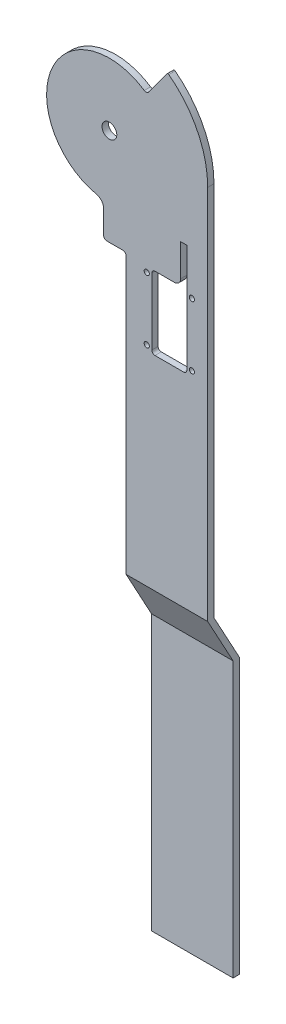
from build123d import *

# Parameters (mm, degrees)
SKETCH1_R           = 2.992510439
SKETCH1_R_2         = 1.04267733
BOSS_EXTRUDE4_DEPTH = 1.27
BOSS_EXTRUDE5_DEPTH = 32.991177


with BuildPart() as part:
    # Sketch1 → Boss-Extrude4 (new, symmetric)
    with BuildSketch(Plane.XY):
        with BuildLine():
            Line((39.754457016, 0), (39.754457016, -152.047689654))
            Line((39.754457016, -152.047689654), (6.763281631, -152.047689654))
            Line((6.763281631, -152.047689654), (6.763281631, -40.444926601))
            ThreePointArc((6.763281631, -40.444926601), (6.391307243, -39.546900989), (5.493281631, -39.174926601))
            Line((5.493281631, -39.174926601), (-1.041811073, -39.174926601))
            ThreePointArc((-1.041811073, -39.174926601), (-1.939836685, -38.802952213), (-2.311811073, -37.904926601))
            Line((-2.311811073, -37.904926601), (-2.311811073, -28.561294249))
            ThreePointArc((-2.311811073, -28.561294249), (-3.158841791, -26.166108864), (-5.323313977, -24.835908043))
            ThreePointArc((-5.323313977, -24.835908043), (-23.397014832, 9.886338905), (14.098576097, 21.12794718))
            ThreePointArc((14.098576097, 21.12794718), (15.022298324, 20.933333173), (15.825135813, 21.429910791))
            Line((15.825135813, 21.429910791), (23.312103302, 31.568531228))
            ThreePointArc((23.312103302, 31.568531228), (23.648433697, 31.769583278), (24.027793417, 31.67146975))
            ThreePointArc((24.027793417, 31.67146975), (35.606380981, 17.680568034), (39.754457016, 0))
        make_face()
        Circle(SKETCH1_R, mode=Mode.SUBTRACT)
        with Locations((15.102918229, -42.097738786)):
            Circle(SKETCH1_R_2, mode=Mode.SUBTRACT)
        with Locations((33.380396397, -42.097738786)):
            Circle(SKETCH1_R_2, mode=Mode.SUBTRACT)
        with Locations((33.380396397, -67.459551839)):
            Circle(SKETCH1_R_2, mode=Mode.SUBTRACT)
        with Locations((15.102918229, -67.459551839)):
            Circle(SKETCH1_R_2, mode=Mode.SUBTRACT)
        with BuildLine():
            Line((28.819270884, -27.383690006), (28.819270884, -24.466742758))
            Line((28.819270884, -24.466742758), (31.333613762, -24.466742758))
            Line((31.333613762, -24.466742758), (31.333613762, -68.278700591))
            ThreePointArc((31.333613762, -68.278700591), (30.961639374, -69.176726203), (30.063613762, -69.548700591))
            Line((30.063613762, -69.548700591), (18.419700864, -69.548700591))
            ThreePointArc((18.419700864, -69.548700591), (17.521675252, -69.176726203), (17.149700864, -68.278700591))
            Line((17.149700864, -68.278700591), (17.149700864, -41.278590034))
            ThreePointArc((17.149700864, -41.278590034), (17.521675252, -40.380564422), (18.419700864, -40.008590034))
            Line((18.419700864, -40.008590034), (26.279270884, -40.008590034))
            ThreePointArc((26.279270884, -40.008590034), (28.075322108, -39.264641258), (28.819270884, -37.468590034))
            Line((28.819270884, -37.468590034), (28.819270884, -27.383690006))
        make_face(mode=Mode.SUBTRACT)
    extrude(amount=BOSS_EXTRUDE4_DEPTH, both=True)

    # Sketch3 → Boss-Extrude5 (add)
    with BuildSketch(Plane(origin=(39.754457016, 0, 0), x_dir=(0, 0, -1), z_dir=(1, 0, 0))):
        Polygon((-1.27, -152.047689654), (1.27, -152.047689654), (11.549242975, -170.986501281), (11.549242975, -282.0708604), (9.009242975, -282.0708604), (9.009242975, -170.986501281), align=None)
    extrude(amount=-BOSS_EXTRUDE5_DEPTH)


solid = part.part
